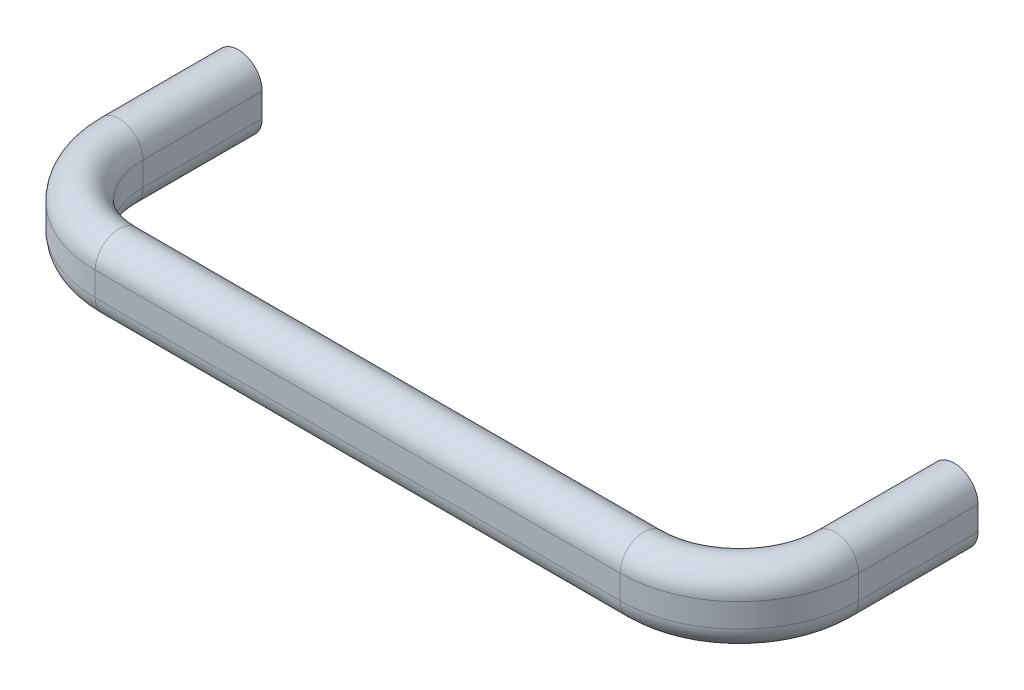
ISO-10303-21;
HEADER;
FILE_DESCRIPTION(('STEP AP214'),'2;1');
FILE_NAME('part.step','',(''),(''),'','','');
FILE_SCHEMA(('AUTOMOTIVE_DESIGN { 1 0 10303 214 1 1 1 1 }'));
ENDSEC;
DATA;
#1=APPLICATION_CONTEXT('core data for automotive mechanical design processes');
#2=APPLICATION_PROTOCOL_DEFINITION('international standard','automotive_design',2000,#1);
#3=PRODUCT_CONTEXT('',#1,'mechanical');
#4=PRODUCT('Part','Part','',(#3));
#5=PRODUCT_RELATED_PRODUCT_CATEGORY('part','',(#4));
#6=PRODUCT_DEFINITION_FORMATION('','',#4);
#7=PRODUCT_DEFINITION_CONTEXT('part definition',#1,'design');
#8=PRODUCT_DEFINITION('design','',#6,#7);
#9=PRODUCT_DEFINITION_SHAPE('','',#8);
#10=(LENGTH_UNIT() NAMED_UNIT(*) SI_UNIT(.MILLI.,.METRE.));
#11=(NAMED_UNIT(*) PLANE_ANGLE_UNIT() SI_UNIT($,.RADIAN.));
#12=(NAMED_UNIT(*) SI_UNIT($,.STERADIAN.) SOLID_ANGLE_UNIT());
#13=UNCERTAINTY_MEASURE_WITH_UNIT(LENGTH_MEASURE(1.E-05),#10,'distance_accuracy_value','');
#14=(GEOMETRIC_REPRESENTATION_CONTEXT(3) GLOBAL_UNCERTAINTY_ASSIGNED_CONTEXT((#13)) GLOBAL_UNIT_ASSIGNED_CONTEXT((#10,
#11,#12)) REPRESENTATION_CONTEXT('',''));
#15=CARTESIAN_POINT('',(0.,0.,0.));
#16=DIRECTION('',(0.,0.,1.));
#17=DIRECTION('',(1.,0.,0.));
#18=AXIS2_PLACEMENT_3D('',#15,#16,#17);
#19=CARTESIAN_POINT('',(0.,2.,0.));
#20=DIRECTION('',(0.,0.,-1.));
#21=DIRECTION('',(0.,1.,0.));
#22=AXIS2_PLACEMENT_3D('',#19,#20,#21);
#23=PLANE('',#22);
#24=CARTESIAN_POINT('',(0.,2.,0.));
#25=DIRECTION('',(0.,0.,-1.));
#26=DIRECTION('',(0.,1.,0.));
#27=AXIS2_PLACEMENT_3D('',#24,#25,#26);
#28=CIRCLE('',#27,4.);
#29=CARTESIAN_POINT('',(-4.,2.,0.));
#30=VERTEX_POINT('',#29);
#31=CARTESIAN_POINT('',(4.,2.,0.));
#32=VERTEX_POINT('',#31);
#33=EDGE_CURVE('E31',#30,#32,#28,.T.);
#34=ORIENTED_EDGE('',*,*,#33,.T.);
#35=DIRECTION('',(0.,-1.,0.));
#36=VECTOR('',#35,1.);
#37=CARTESIAN_POINT('',(4.,2.,0.));
#38=LINE('',#37,#36);
#39=CARTESIAN_POINT('',(4.,-2.,0.));
#40=VERTEX_POINT('',#39);
#41=EDGE_CURVE('E18',#32,#40,#38,.T.);
#42=ORIENTED_EDGE('',*,*,#41,.T.);
#43=CARTESIAN_POINT('',(0.,-2.,0.));
#44=DIRECTION('',(0.,0.,-1.));
#45=DIRECTION('',(0.,1.,0.));
#46=AXIS2_PLACEMENT_3D('',#43,#44,#45);
#47=CIRCLE('',#46,4.);
#48=CARTESIAN_POINT('',(-4.,-2.,0.));
#49=VERTEX_POINT('',#48);
#50=EDGE_CURVE('E39',#40,#49,#47,.T.);
#51=ORIENTED_EDGE('',*,*,#50,.T.);
#52=DIRECTION('',(0.,-1.,0.));
#53=VECTOR('',#52,1.);
#54=CARTESIAN_POINT('',(-4.,2.,0.));
#55=LINE('',#54,#53);
#56=EDGE_CURVE('E230',#30,#49,#55,.T.);
#57=ORIENTED_EDGE('',*,*,#56,.F.);
#58=EDGE_LOOP('',(#34,#42,#51,#57));
#59=FACE_BOUND('',#58,.T.);
#60=CARTESIAN_POINT('',(0.,0.,-2.28837131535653E-13));
#61=DIRECTION('',(0.,0.,-1.));
#62=DIRECTION('',(0.,1.,0.));
#63=AXIS2_PLACEMENT_3D('',#60,#61,#62);
#64=CIRCLE('',#63,2.96700000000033);
#65=CARTESIAN_POINT('',(0.,2.96700000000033,-2.28837131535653E-13));
#66=VERTEX_POINT('',#65);
#67=EDGE_CURVE('E542',#66,#66,#64,.T.);
#68=ORIENTED_EDGE('',*,*,#67,.F.);
#69=EDGE_LOOP('',(#68));
#70=FACE_BOUND('',#69,.T.);
#71=ADVANCED_FACE('F14',(#59,#70),#23,.T.);
#72=CARTESIAN_POINT('',(120.,2.,0.));
#73=DIRECTION('',(0.,0.,1.));
#74=DIRECTION('',(0.,1.,0.));
#75=AXIS2_PLACEMENT_3D('',#72,#73,#74);
#76=PLANE('',#75);
#77=CARTESIAN_POINT('',(120.,2.,0.));
#78=DIRECTION('',(0.,0.,1.));
#79=DIRECTION('',(0.,1.,0.));
#80=AXIS2_PLACEMENT_3D('',#77,#78,#79);
#81=CIRCLE('',#80,4.);
#82=CARTESIAN_POINT('',(124.,2.,0.));
#83=VERTEX_POINT('',#82);
#84=CARTESIAN_POINT('',(116.,2.,0.));
#85=VERTEX_POINT('',#84);
#86=EDGE_CURVE('E107',#83,#85,#81,.T.);
#87=ORIENTED_EDGE('',*,*,#86,.F.);
#88=DIRECTION('',(0.,-1.,0.));
#89=VECTOR('',#88,1.);
#90=CARTESIAN_POINT('',(124.,2.,0.));
#91=LINE('',#90,#89);
#92=CARTESIAN_POINT('',(124.,-2.,0.));
#93=VERTEX_POINT('',#92);
#94=EDGE_CURVE('E136',#83,#93,#91,.T.);
#95=ORIENTED_EDGE('',*,*,#94,.T.);
#96=CARTESIAN_POINT('',(120.,-2.,0.));
#97=DIRECTION('',(0.,0.,1.));
#98=DIRECTION('',(0.,1.,0.));
#99=AXIS2_PLACEMENT_3D('',#96,#97,#98);
#100=CIRCLE('',#99,4.);
#101=CARTESIAN_POINT('',(116.,-2.,0.));
#102=VERTEX_POINT('',#101);
#103=EDGE_CURVE('E134',#102,#93,#100,.T.);
#104=ORIENTED_EDGE('',*,*,#103,.F.);
#105=DIRECTION('',(0.,-1.,0.));
#106=VECTOR('',#105,1.);
#107=CARTESIAN_POINT('',(116.,2.,0.));
#108=LINE('',#107,#106);
#109=EDGE_CURVE('E119',#85,#102,#108,.T.);
#110=ORIENTED_EDGE('',*,*,#109,.F.);
#111=EDGE_LOOP('',(#87,#95,#104,#110));
#112=FACE_BOUND('',#111,.T.);
#113=CARTESIAN_POINT('',(120.,0.,-2.28837131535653E-13));
#114=DIRECTION('',(0.,0.,1.));
#115=DIRECTION('',(0.,1.,0.));
#116=AXIS2_PLACEMENT_3D('',#113,#114,#115);
#117=CIRCLE('',#116,2.96700000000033);
#118=CARTESIAN_POINT('',(120.,2.96700000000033,-2.28837131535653E-13));
#119=VERTEX_POINT('',#118);
#120=EDGE_CURVE('E120',#119,#119,#117,.T.);
#121=ORIENTED_EDGE('',*,*,#120,.T.);
#122=EDGE_LOOP('',(#121));
#123=FACE_BOUND('',#122,.T.);
#124=ADVANCED_FACE('F132',(#112,#123),#76,.F.);
#125=CARTESIAN_POINT('',(4.,2.,20.));
#126=DIRECTION('',(1.,0.,0.));
#127=DIRECTION('',(0.,1.,0.));
#128=AXIS2_PLACEMENT_3D('',#125,#126,#127);
#129=PLANE('',#128);
#130=DIRECTION('',(0.,-1.,0.));
#131=VECTOR('',#130,1.);
#132=CARTESIAN_POINT('',(4.,2.,20.));
#133=LINE('',#132,#131);
#134=CARTESIAN_POINT('',(4.,2.,20.));
#135=VERTEX_POINT('',#134);
#136=CARTESIAN_POINT('',(4.,-2.,20.));
#137=VERTEX_POINT('',#136);
#138=EDGE_CURVE('E204',#135,#137,#133,.T.);
#139=ORIENTED_EDGE('',*,*,#138,.T.);
#140=DIRECTION('',(0.,0.,-1.));
#141=VECTOR('',#140,1.);
#142=CARTESIAN_POINT('',(4.,-2.,20.));
#143=LINE('',#142,#141);
#144=EDGE_CURVE('E23',#137,#40,#143,.T.);
#145=ORIENTED_EDGE('',*,*,#144,.T.);
#146=ORIENTED_EDGE('',*,*,#41,.F.);
#147=DIRECTION('',(0.,0.,-1.));
#148=VECTOR('',#147,1.);
#149=CARTESIAN_POINT('',(4.,2.,20.));
#150=LINE('',#149,#148);
#151=EDGE_CURVE('E9',#135,#32,#150,.T.);
#152=ORIENTED_EDGE('',*,*,#151,.F.);
#153=EDGE_LOOP('',(#139,#145,#146,#152));
#154=FACE_BOUND('',#153,.T.);
#155=ADVANCED_FACE('F16',(#154),#129,.T.);
#156=CARTESIAN_POINT('',(0.,-2.,20.));
#157=DIRECTION('',(0.,0.,-1.));
#158=DIRECTION('',(0.,-1.,0.));
#159=AXIS2_PLACEMENT_3D('',#156,#157,#158);
#160=CYLINDRICAL_SURFACE('',#159,4.);
#161=CARTESIAN_POINT('',(0.,-2.,20.));
#162=DIRECTION('',(0.,0.,-1.));
#163=DIRECTION('',(0.,1.,0.));
#164=AXIS2_PLACEMENT_3D('',#161,#162,#163);
#165=CIRCLE('',#164,4.);
#166=CARTESIAN_POINT('',(-4.,-2.,20.));
#167=VERTEX_POINT('',#166);
#168=EDGE_CURVE('E217',#137,#167,#165,.T.);
#169=ORIENTED_EDGE('',*,*,#168,.T.);
#170=DIRECTION('',(0.,0.,-1.));
#171=VECTOR('',#170,1.);
#172=CARTESIAN_POINT('',(-4.,-2.,20.));
#173=LINE('',#172,#171);
#174=EDGE_CURVE('E225',#167,#49,#173,.T.);
#175=ORIENTED_EDGE('',*,*,#174,.T.);
#176=ORIENTED_EDGE('',*,*,#50,.F.);
#177=ORIENTED_EDGE('',*,*,#144,.F.);
#178=EDGE_LOOP('',(#169,#175,#176,#177));
#179=FACE_BOUND('',#178,.T.);
#180=ADVANCED_FACE('F235',(#179),#160,.T.);
#181=CARTESIAN_POINT('',(-4.,2.,20.));
#182=DIRECTION('',(1.,0.,0.));
#183=DIRECTION('',(0.,1.,0.));
#184=AXIS2_PLACEMENT_3D('',#181,#182,#183);
#185=PLANE('',#184);
#186=DIRECTION('',(0.,-1.,0.));
#187=VECTOR('',#186,1.);
#188=CARTESIAN_POINT('',(-4.,2.,20.));
#189=LINE('',#188,#187);
#190=CARTESIAN_POINT('',(-4.,2.,20.));
#191=VERTEX_POINT('',#190);
#192=EDGE_CURVE('E214',#191,#167,#189,.T.);
#193=ORIENTED_EDGE('',*,*,#192,.F.);
#194=DIRECTION('',(0.,0.,-1.));
#195=VECTOR('',#194,1.);
#196=CARTESIAN_POINT('',(-4.,2.,20.));
#197=LINE('',#196,#195);
#198=EDGE_CURVE('E222',#191,#30,#197,.T.);
#199=ORIENTED_EDGE('',*,*,#198,.T.);
#200=ORIENTED_EDGE('',*,*,#56,.T.);
#201=ORIENTED_EDGE('',*,*,#174,.F.);
#202=EDGE_LOOP('',(#193,#199,#200,#201));
#203=FACE_BOUND('',#202,.T.);
#204=ADVANCED_FACE('F292',(#203),#185,.F.);
#205=CARTESIAN_POINT('',(0.,2.,20.));
#206=DIRECTION('',(0.,0.,-1.));
#207=DIRECTION('',(0.,-1.,0.));
#208=AXIS2_PLACEMENT_3D('',#205,#206,#207);
#209=CYLINDRICAL_SURFACE('',#208,4.);
#210=CARTESIAN_POINT('',(0.,2.,20.));
#211=DIRECTION('',(0.,0.,-1.));
#212=DIRECTION('',(0.,1.,0.));
#213=AXIS2_PLACEMENT_3D('',#210,#211,#212);
#214=CIRCLE('',#213,4.);
#215=EDGE_CURVE('E190',#191,#135,#214,.T.);
#216=ORIENTED_EDGE('',*,*,#215,.T.);
#217=ORIENTED_EDGE('',*,*,#151,.T.);
#218=ORIENTED_EDGE('',*,*,#33,.F.);
#219=ORIENTED_EDGE('',*,*,#198,.F.);
#220=EDGE_LOOP('',(#216,#217,#218,#219));
#221=FACE_BOUND('',#220,.T.);
#222=ADVANCED_FACE('F283',(#221),#209,.T.);
#223=CARTESIAN_POINT('',(16.,0.,20.));
#224=DIRECTION('',(0.,-1.,0.));
#225=DIRECTION('',(1.,0.,0.));
#226=AXIS2_PLACEMENT_3D('',#223,#224,#225);
#227=CYLINDRICAL_SURFACE('',#226,12.);
#228=DIRECTION('',(0.,-1.,0.));
#229=VECTOR('',#228,1.);
#230=CARTESIAN_POINT('',(16.,2.,32.));
#231=LINE('',#230,#229);
#232=CARTESIAN_POINT('',(16.,2.,32.));
#233=VERTEX_POINT('',#232);
#234=CARTESIAN_POINT('',(16.,-2.,32.));
#235=VERTEX_POINT('',#234);
#236=EDGE_CURVE('E181',#233,#235,#231,.T.);
#237=ORIENTED_EDGE('',*,*,#236,.T.);
#238=CARTESIAN_POINT('',(16.,-2.,20.));
#239=DIRECTION('',(0.,-1.,0.));
#240=DIRECTION('',(1.,0.,0.));
#241=AXIS2_PLACEMENT_3D('',#238,#239,#240);
#242=CIRCLE('',#241,12.);
#243=EDGE_CURVE('E207',#235,#137,#242,.T.);
#244=ORIENTED_EDGE('',*,*,#243,.T.);
#245=ORIENTED_EDGE('',*,*,#138,.F.);
#246=CARTESIAN_POINT('',(16.,2.,20.));
#247=DIRECTION('',(0.,-1.,0.));
#248=DIRECTION('',(1.,0.,0.));
#249=AXIS2_PLACEMENT_3D('',#246,#247,#248);
#250=CIRCLE('',#249,12.);
#251=EDGE_CURVE('E210',#233,#135,#250,.T.);
#252=ORIENTED_EDGE('',*,*,#251,.F.);
#253=EDGE_LOOP('',(#237,#244,#245,#252));
#254=FACE_BOUND('',#253,.T.);
#255=ADVANCED_FACE('F281',(#254),#227,.F.);
#256=CARTESIAN_POINT('',(16.,-2.,20.));
#257=DIRECTION('',(0.,-1.,0.));
#258=DIRECTION('',(1.,0.,0.));
#259=AXIS2_PLACEMENT_3D('',#256,#257,#258);
#260=TOROIDAL_SURFACE('',#259,16.,4.);
#261=CARTESIAN_POINT('',(16.,-2.,36.));
#262=DIRECTION('',(-1.,0.,0.));
#263=DIRECTION('',(0.,1.,0.));
#264=AXIS2_PLACEMENT_3D('',#261,#262,#263);
#265=CIRCLE('',#264,4.);
#266=CARTESIAN_POINT('',(16.,-2.,40.));
#267=VERTEX_POINT('',#266);
#268=EDGE_CURVE('E195',#235,#267,#265,.T.);
#269=ORIENTED_EDGE('',*,*,#268,.T.);
#270=CARTESIAN_POINT('',(16.,-2.,20.));
#271=DIRECTION('',(0.,-1.,0.));
#272=DIRECTION('',(1.,0.,0.));
#273=AXIS2_PLACEMENT_3D('',#270,#271,#272);
#274=CIRCLE('',#273,20.);
#275=EDGE_CURVE('E203',#267,#167,#274,.T.);
#276=ORIENTED_EDGE('',*,*,#275,.T.);
#277=ORIENTED_EDGE('',*,*,#168,.F.);
#278=ORIENTED_EDGE('',*,*,#243,.F.);
#279=EDGE_LOOP('',(#269,#276,#277,#278));
#280=FACE_BOUND('',#279,.T.);
#281=ADVANCED_FACE('F244',(#280),#260,.T.);
#282=CARTESIAN_POINT('',(16.,0.,20.));
#283=DIRECTION('',(0.,-1.,0.));
#284=DIRECTION('',(1.,0.,0.));
#285=AXIS2_PLACEMENT_3D('',#282,#283,#284);
#286=CYLINDRICAL_SURFACE('',#285,20.);
#287=DIRECTION('',(0.,-1.,0.));
#288=VECTOR('',#287,1.);
#289=CARTESIAN_POINT('',(16.,2.,40.));
#290=LINE('',#289,#288);
#291=CARTESIAN_POINT('',(16.,2.,40.));
#292=VERTEX_POINT('',#291);
#293=EDGE_CURVE('E192',#292,#267,#290,.T.);
#294=ORIENTED_EDGE('',*,*,#293,.F.);
#295=CARTESIAN_POINT('',(16.,2.,20.));
#296=DIRECTION('',(0.,-1.,0.));
#297=DIRECTION('',(1.,0.,0.));
#298=AXIS2_PLACEMENT_3D('',#295,#296,#297);
#299=CIRCLE('',#298,20.);
#300=EDGE_CURVE('E200',#292,#191,#299,.T.);
#301=ORIENTED_EDGE('',*,*,#300,.T.);
#302=ORIENTED_EDGE('',*,*,#192,.T.);
#303=ORIENTED_EDGE('',*,*,#275,.F.);
#304=EDGE_LOOP('',(#294,#301,#302,#303));
#305=FACE_BOUND('',#304,.T.);
#306=ADVANCED_FACE('F241',(#305),#286,.T.);
#307=CARTESIAN_POINT('',(16.,2.,20.));
#308=DIRECTION('',(0.,-1.,0.));
#309=DIRECTION('',(1.,0.,0.));
#310=AXIS2_PLACEMENT_3D('',#307,#308,#309);
#311=TOROIDAL_SURFACE('',#310,16.,4.);
#312=CARTESIAN_POINT('',(16.,2.,36.));
#313=DIRECTION('',(-1.,0.,0.));
#314=DIRECTION('',(0.,1.,0.));
#315=AXIS2_PLACEMENT_3D('',#312,#313,#314);
#316=CIRCLE('',#315,4.);
#317=EDGE_CURVE('E167',#292,#233,#316,.T.);
#318=ORIENTED_EDGE('',*,*,#317,.T.);
#319=ORIENTED_EDGE('',*,*,#251,.T.);
#320=ORIENTED_EDGE('',*,*,#215,.F.);
#321=ORIENTED_EDGE('',*,*,#300,.F.);
#322=EDGE_LOOP('',(#318,#319,#320,#321));
#323=FACE_BOUND('',#322,.T.);
#324=ADVANCED_FACE('F279',(#323),#311,.T.);
#325=CARTESIAN_POINT('',(104.,2.,32.));
#326=DIRECTION('',(0.,0.,-1.));
#327=DIRECTION('',(-1.,0.,0.));
#328=AXIS2_PLACEMENT_3D('',#325,#326,#327);
#329=PLANE('',#328);
#330=DIRECTION('',(0.,-1.,0.));
#331=VECTOR('',#330,1.);
#332=CARTESIAN_POINT('',(104.,2.,32.));
#333=LINE('',#332,#331);
#334=CARTESIAN_POINT('',(104.,2.,32.));
#335=VERTEX_POINT('',#334);
#336=CARTESIAN_POINT('',(104.,-2.,32.));
#337=VERTEX_POINT('',#336);
#338=EDGE_CURVE('E158',#335,#337,#333,.T.);
#339=ORIENTED_EDGE('',*,*,#338,.T.);
#340=DIRECTION('',(-1.,0.,0.));
#341=VECTOR('',#340,1.);
#342=CARTESIAN_POINT('',(104.,-2.,32.));
#343=LINE('',#342,#341);
#344=EDGE_CURVE('E184',#337,#235,#343,.T.);
#345=ORIENTED_EDGE('',*,*,#344,.T.);
#346=ORIENTED_EDGE('',*,*,#236,.F.);
#347=DIRECTION('',(-1.,0.,0.));
#348=VECTOR('',#347,1.);
#349=CARTESIAN_POINT('',(104.,2.,32.));
#350=LINE('',#349,#348);
#351=EDGE_CURVE('E187',#335,#233,#350,.T.);
#352=ORIENTED_EDGE('',*,*,#351,.F.);
#353=EDGE_LOOP('',(#339,#345,#346,#352));
#354=FACE_BOUND('',#353,.T.);
#355=ADVANCED_FACE('F273',(#354),#329,.T.);
#356=CARTESIAN_POINT('',(104.,-2.,36.));
#357=DIRECTION('',(-1.,0.,0.));
#358=DIRECTION('',(0.,0.,1.));
#359=AXIS2_PLACEMENT_3D('',#356,#357,#358);
#360=CYLINDRICAL_SURFACE('',#359,4.);
#361=CARTESIAN_POINT('',(104.,-2.,36.));
#362=DIRECTION('',(-1.,0.,0.));
#363=DIRECTION('',(0.,1.,0.));
#364=AXIS2_PLACEMENT_3D('',#361,#362,#363);
#365=CIRCLE('',#364,4.);
#366=CARTESIAN_POINT('',(104.,-2.,40.));
#367=VERTEX_POINT('',#366);
#368=EDGE_CURVE('E172',#337,#367,#365,.T.);
#369=ORIENTED_EDGE('',*,*,#368,.T.);
#370=DIRECTION('',(-1.,0.,0.));
#371=VECTOR('',#370,1.);
#372=CARTESIAN_POINT('',(104.,-2.,40.));
#373=LINE('',#372,#371);
#374=EDGE_CURVE('E180',#367,#267,#373,.T.);
#375=ORIENTED_EDGE('',*,*,#374,.T.);
#376=ORIENTED_EDGE('',*,*,#268,.F.);
#377=ORIENTED_EDGE('',*,*,#344,.F.);
#378=EDGE_LOOP('',(#369,#375,#376,#377));
#379=FACE_BOUND('',#378,.T.);
#380=ADVANCED_FACE('F251',(#379),#360,.T.);
#381=CARTESIAN_POINT('',(104.,2.,40.));
#382=DIRECTION('',(0.,0.,-1.));
#383=DIRECTION('',(-1.,0.,0.));
#384=AXIS2_PLACEMENT_3D('',#381,#382,#383);
#385=PLANE('',#384);
#386=DIRECTION('',(0.,-1.,0.));
#387=VECTOR('',#386,1.);
#388=CARTESIAN_POINT('',(104.,2.,40.));
#389=LINE('',#388,#387);
#390=CARTESIAN_POINT('',(104.,2.,40.));
#391=VERTEX_POINT('',#390);
#392=EDGE_CURVE('E169',#391,#367,#389,.T.);
#393=ORIENTED_EDGE('',*,*,#392,.F.);
#394=DIRECTION('',(-1.,0.,0.));
#395=VECTOR('',#394,1.);
#396=CARTESIAN_POINT('',(104.,2.,40.));
#397=LINE('',#396,#395);
#398=EDGE_CURVE('E177',#391,#292,#397,.T.);
#399=ORIENTED_EDGE('',*,*,#398,.T.);
#400=ORIENTED_EDGE('',*,*,#293,.T.);
#401=ORIENTED_EDGE('',*,*,#374,.F.);
#402=EDGE_LOOP('',(#393,#399,#400,#401));
#403=FACE_BOUND('',#402,.T.);
#404=ADVANCED_FACE('F249',(#403),#385,.F.);
#405=CARTESIAN_POINT('',(104.,2.,36.));
#406=DIRECTION('',(-1.,0.,0.));
#407=DIRECTION('',(0.,0.,1.));
#408=AXIS2_PLACEMENT_3D('',#405,#406,#407);
#409=CYLINDRICAL_SURFACE('',#408,4.);
#410=CARTESIAN_POINT('',(104.,2.,36.));
#411=DIRECTION('',(-1.,0.,0.));
#412=DIRECTION('',(0.,1.,0.));
#413=AXIS2_PLACEMENT_3D('',#410,#411,#412);
#414=CIRCLE('',#413,4.);
#415=EDGE_CURVE('E129',#391,#335,#414,.T.);
#416=ORIENTED_EDGE('',*,*,#415,.T.);
#417=ORIENTED_EDGE('',*,*,#351,.T.);
#418=ORIENTED_EDGE('',*,*,#317,.F.);
#419=ORIENTED_EDGE('',*,*,#398,.F.);
#420=EDGE_LOOP('',(#416,#417,#418,#419));
#421=FACE_BOUND('',#420,.T.);
#422=ADVANCED_FACE('F276',(#421),#409,.T.);
#423=CARTESIAN_POINT('',(104.,0.,20.));
#424=DIRECTION('',(0.,-1.,0.));
#425=DIRECTION('',(1.,0.,0.));
#426=AXIS2_PLACEMENT_3D('',#423,#424,#425);
#427=CYLINDRICAL_SURFACE('',#426,12.);
#428=DIRECTION('',(0.,-1.,0.));
#429=VECTOR('',#428,1.);
#430=CARTESIAN_POINT('',(116.,2.,20.));
#431=LINE('',#430,#429);
#432=CARTESIAN_POINT('',(116.,2.,20.));
#433=VERTEX_POINT('',#432);
#434=CARTESIAN_POINT('',(116.,-2.,20.));
#435=VERTEX_POINT('',#434);
#436=EDGE_CURVE('E128',#433,#435,#431,.T.);
#437=ORIENTED_EDGE('',*,*,#436,.T.);
#438=CARTESIAN_POINT('',(104.,-2.,20.));
#439=DIRECTION('',(0.,-1.,0.));
#440=DIRECTION('',(1.,0.,0.));
#441=AXIS2_PLACEMENT_3D('',#438,#439,#440);
#442=CIRCLE('',#441,12.);
#443=EDGE_CURVE('E161',#435,#337,#442,.T.);
#444=ORIENTED_EDGE('',*,*,#443,.T.);
#445=ORIENTED_EDGE('',*,*,#338,.F.);
#446=CARTESIAN_POINT('',(104.,2.,20.));
#447=DIRECTION('',(0.,-1.,0.));
#448=DIRECTION('',(1.,0.,0.));
#449=AXIS2_PLACEMENT_3D('',#446,#447,#448);
#450=CIRCLE('',#449,12.);
#451=EDGE_CURVE('E164',#433,#335,#450,.T.);
#452=ORIENTED_EDGE('',*,*,#451,.F.);
#453=EDGE_LOOP('',(#437,#444,#445,#452));
#454=FACE_BOUND('',#453,.T.);
#455=ADVANCED_FACE('F270',(#454),#427,.F.);
#456=CARTESIAN_POINT('',(104.,-2.,20.));
#457=DIRECTION('',(0.,-1.,0.));
#458=DIRECTION('',(1.,0.,0.));
#459=AXIS2_PLACEMENT_3D('',#456,#457,#458);
#460=TOROIDAL_SURFACE('',#459,16.,4.);
#461=CARTESIAN_POINT('',(120.,-2.,20.));
#462=DIRECTION('',(0.,0.,1.));
#463=DIRECTION('',(0.,1.,0.));
#464=AXIS2_PLACEMENT_3D('',#461,#462,#463);
#465=CIRCLE('',#464,4.);
#466=CARTESIAN_POINT('',(124.,-2.,20.));
#467=VERTEX_POINT('',#466);
#468=EDGE_CURVE('E144',#435,#467,#465,.T.);
#469=ORIENTED_EDGE('',*,*,#468,.T.);
#470=CARTESIAN_POINT('',(104.,-2.,20.));
#471=DIRECTION('',(0.,-1.,0.));
#472=DIRECTION('',(1.,0.,0.));
#473=AXIS2_PLACEMENT_3D('',#470,#471,#472);
#474=CIRCLE('',#473,20.);
#475=EDGE_CURVE('E157',#467,#367,#474,.T.);
#476=ORIENTED_EDGE('',*,*,#475,.T.);
#477=ORIENTED_EDGE('',*,*,#368,.F.);
#478=ORIENTED_EDGE('',*,*,#443,.F.);
#479=EDGE_LOOP('',(#469,#476,#477,#478));
#480=FACE_BOUND('',#479,.T.);
#481=ADVANCED_FACE('F259',(#480),#460,.T.);
#482=CARTESIAN_POINT('',(104.,0.,20.));
#483=DIRECTION('',(0.,-1.,0.));
#484=DIRECTION('',(1.,0.,0.));
#485=AXIS2_PLACEMENT_3D('',#482,#483,#484);
#486=CYLINDRICAL_SURFACE('',#485,20.);
#487=DIRECTION('',(0.,-1.,0.));
#488=VECTOR('',#487,1.);
#489=CARTESIAN_POINT('',(124.,2.,20.));
#490=LINE('',#489,#488);
#491=CARTESIAN_POINT('',(124.,2.,20.));
#492=VERTEX_POINT('',#491);
#493=EDGE_CURVE('E146',#492,#467,#490,.T.);
#494=ORIENTED_EDGE('',*,*,#493,.F.);
#495=CARTESIAN_POINT('',(104.,2.,20.));
#496=DIRECTION('',(0.,-1.,0.));
#497=DIRECTION('',(1.,0.,0.));
#498=AXIS2_PLACEMENT_3D('',#495,#496,#497);
#499=CIRCLE('',#498,20.);
#500=EDGE_CURVE('E154',#492,#391,#499,.T.);
#501=ORIENTED_EDGE('',*,*,#500,.T.);
#502=ORIENTED_EDGE('',*,*,#392,.T.);
#503=ORIENTED_EDGE('',*,*,#475,.F.);
#504=EDGE_LOOP('',(#494,#501,#502,#503));
#505=FACE_BOUND('',#504,.T.);
#506=ADVANCED_FACE('F256',(#505),#486,.T.);
#507=CARTESIAN_POINT('',(104.,2.,20.));
#508=DIRECTION('',(0.,-1.,0.));
#509=DIRECTION('',(1.,0.,0.));
#510=AXIS2_PLACEMENT_3D('',#507,#508,#509);
#511=TOROIDAL_SURFACE('',#510,16.,4.);
#512=CARTESIAN_POINT('',(120.,2.,20.));
#513=DIRECTION('',(0.,0.,1.));
#514=DIRECTION('',(0.,1.,0.));
#515=AXIS2_PLACEMENT_3D('',#512,#513,#514);
#516=CIRCLE('',#515,4.);
#517=EDGE_CURVE('E141',#492,#433,#516,.T.);
#518=ORIENTED_EDGE('',*,*,#517,.T.);
#519=ORIENTED_EDGE('',*,*,#451,.T.);
#520=ORIENTED_EDGE('',*,*,#415,.F.);
#521=ORIENTED_EDGE('',*,*,#500,.F.);
#522=EDGE_LOOP('',(#518,#519,#520,#521));
#523=FACE_BOUND('',#522,.T.);
#524=ADVANCED_FACE('F267',(#523),#511,.T.);
#525=CARTESIAN_POINT('',(120.,2.,20.));
#526=DIRECTION('',(0.,0.,-1.));
#527=DIRECTION('',(0.,-1.,0.));
#528=AXIS2_PLACEMENT_3D('',#525,#526,#527);
#529=CYLINDRICAL_SURFACE('',#528,4.);
#530=DIRECTION('',(0.,0.,-1.));
#531=VECTOR('',#530,1.);
#532=CARTESIAN_POINT('',(116.,2.,20.));
#533=LINE('',#532,#531);
#534=EDGE_CURVE('E111',#433,#85,#533,.T.);
#535=ORIENTED_EDGE('',*,*,#534,.F.);
#536=ORIENTED_EDGE('',*,*,#517,.F.);
#537=DIRECTION('',(0.,0.,-1.));
#538=VECTOR('',#537,1.);
#539=CARTESIAN_POINT('',(124.,2.,20.));
#540=LINE('',#539,#538);
#541=EDGE_CURVE('E114',#492,#83,#540,.T.);
#542=ORIENTED_EDGE('',*,*,#541,.T.);
#543=ORIENTED_EDGE('',*,*,#86,.T.);
#544=EDGE_LOOP('',(#535,#536,#542,#543));
#545=FACE_BOUND('',#544,.T.);
#546=ADVANCED_FACE('F109',(#545),#529,.T.);
#547=CARTESIAN_POINT('',(116.,2.,20.));
#548=DIRECTION('',(1.,0.,0.));
#549=DIRECTION('',(0.,1.,0.));
#550=AXIS2_PLACEMENT_3D('',#547,#548,#549);
#551=PLANE('',#550);
#552=DIRECTION('',(0.,0.,-1.));
#553=VECTOR('',#552,1.);
#554=CARTESIAN_POINT('',(116.,-2.,20.));
#555=LINE('',#554,#553);
#556=EDGE_CURVE('E130',#435,#102,#555,.T.);
#557=ORIENTED_EDGE('',*,*,#556,.F.);
#558=ORIENTED_EDGE('',*,*,#436,.F.);
#559=ORIENTED_EDGE('',*,*,#534,.T.);
#560=ORIENTED_EDGE('',*,*,#109,.T.);
#561=EDGE_LOOP('',(#557,#558,#559,#560));
#562=FACE_BOUND('',#561,.T.);
#563=ADVANCED_FACE('F125',(#562),#551,.F.);
#564=CARTESIAN_POINT('',(120.,-2.,20.));
#565=DIRECTION('',(0.,0.,-1.));
#566=DIRECTION('',(0.,-1.,0.));
#567=AXIS2_PLACEMENT_3D('',#564,#565,#566);
#568=CYLINDRICAL_SURFACE('',#567,4.);
#569=DIRECTION('',(0.,0.,-1.));
#570=VECTOR('',#569,1.);
#571=CARTESIAN_POINT('',(124.,-2.,20.));
#572=LINE('',#571,#570);
#573=EDGE_CURVE('E150',#467,#93,#572,.T.);
#574=ORIENTED_EDGE('',*,*,#573,.F.);
#575=ORIENTED_EDGE('',*,*,#468,.F.);
#576=ORIENTED_EDGE('',*,*,#556,.T.);
#577=ORIENTED_EDGE('',*,*,#103,.T.);
#578=EDGE_LOOP('',(#574,#575,#576,#577));
#579=FACE_BOUND('',#578,.T.);
#580=ADVANCED_FACE('F262',(#579),#568,.T.);
#581=CARTESIAN_POINT('',(124.,2.,20.));
#582=DIRECTION('',(1.,0.,0.));
#583=DIRECTION('',(0.,1.,0.));
#584=AXIS2_PLACEMENT_3D('',#581,#582,#583);
#585=PLANE('',#584);
#586=ORIENTED_EDGE('',*,*,#493,.T.);
#587=ORIENTED_EDGE('',*,*,#573,.T.);
#588=ORIENTED_EDGE('',*,*,#94,.F.);
#589=ORIENTED_EDGE('',*,*,#541,.F.);
#590=EDGE_LOOP('',(#586,#587,#588,#589));
#591=FACE_BOUND('',#590,.T.);
#592=ADVANCED_FACE('F264',(#591),#585,.T.);
#593=CARTESIAN_POINT('',(120.,0.,-2.28837131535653E-13));
#594=DIRECTION('',(0.,0.,-1.));
#595=DIRECTION('',(0.,-1.,0.));
#596=AXIS2_PLACEMENT_3D('',#593,#594,#595);
#597=CONICAL_SURFACE('',#596,2.96700000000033,0.785398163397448);
#598=CARTESIAN_POINT('',(120.,0.,0.467000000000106));
#599=DIRECTION('',(0.,0.,-1.));
#600=DIRECTION('',(-1.,0.,0.));
#601=AXIS2_PLACEMENT_3D('',#598,#599,#600);
#602=CIRCLE('',#601,2.5);
#603=CARTESIAN_POINT('',(117.5,0.,0.467000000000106));
#604=VERTEX_POINT('',#603);
#605=EDGE_CURVE('E539',#604,#604,#602,.T.);
#606=ORIENTED_EDGE('',*,*,#605,.F.);
#607=EDGE_LOOP('',(#606));
#608=FACE_BOUND('',#607,.T.);
#609=ORIENTED_EDGE('',*,*,#120,.F.);
#610=EDGE_LOOP('',(#609));
#611=FACE_BOUND('',#610,.T.);
#612=ADVANCED_FACE('F306',(#608,#611),#597,.F.);
#613=CARTESIAN_POINT('',(0.,0.,-2.28837131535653E-13));
#614=DIRECTION('',(0.,0.,-1.));
#615=DIRECTION('',(0.,-1.,0.));
#616=AXIS2_PLACEMENT_3D('',#613,#614,#615);
#617=CONICAL_SURFACE('',#616,2.96700000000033,0.785398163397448);
#618=CARTESIAN_POINT('',(0.,0.,0.467000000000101));
#619=DIRECTION('',(0.,0.,-1.));
#620=DIRECTION('',(-1.,0.,0.));
#621=AXIS2_PLACEMENT_3D('',#618,#619,#620);
#622=CIRCLE('',#621,2.5);
#623=CARTESIAN_POINT('',(-2.5,0.,0.467000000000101));
#624=VERTEX_POINT('',#623);
#625=EDGE_CURVE('E531',#624,#624,#622,.T.);
#626=ORIENTED_EDGE('',*,*,#625,.F.);
#627=EDGE_LOOP('',(#626));
#628=FACE_BOUND('',#627,.T.);
#629=ORIENTED_EDGE('',*,*,#67,.T.);
#630=EDGE_LOOP('',(#629));
#631=FACE_BOUND('',#630,.T.);
#632=ADVANCED_FACE('F414',(#628,#631),#617,.F.);
#633=CARTESIAN_POINT('',(120.,0.,10.));
#634=DIRECTION('',(0.,0.,-1.));
#635=DIRECTION('',(-1.,0.,0.));
#636=AXIS2_PLACEMENT_3D('',#633,#634,#635);
#637=CYLINDRICAL_SURFACE('',#636,2.5);
#638=ORIENTED_EDGE('',*,*,#605,.T.);
#639=EDGE_LOOP('',(#638));
#640=FACE_BOUND('',#639,.T.);
#641=CARTESIAN_POINT('',(120.,0.,10.));
#642=DIRECTION('',(0.,0.,-1.));
#643=DIRECTION('',(-1.,0.,0.));
#644=AXIS2_PLACEMENT_3D('',#641,#642,#643);
#645=CIRCLE('',#644,2.5);
#646=CARTESIAN_POINT('',(117.5,0.,10.));
#647=VERTEX_POINT('',#646);
#648=EDGE_CURVE('E534',#647,#647,#645,.T.);
#649=ORIENTED_EDGE('',*,*,#648,.F.);
#650=EDGE_LOOP('',(#649));
#651=FACE_BOUND('',#650,.T.);
#652=ADVANCED_FACE('F422',(#640,#651),#637,.F.);
#653=CARTESIAN_POINT('',(120.,0.,10.));
#654=DIRECTION('',(0.,0.,-1.));
#655=DIRECTION('',(-1.,0.,0.));
#656=AXIS2_PLACEMENT_3D('',#653,#654,#655);
#657=PLANE('',#656);
#658=ORIENTED_EDGE('',*,*,#648,.T.);
#659=EDGE_LOOP('',(#658));
#660=FACE_BOUND('',#659,.T.);
#661=ADVANCED_FACE('F431',(#660),#657,.T.);
#662=CARTESIAN_POINT('',(0.,0.,10.));
#663=DIRECTION('',(0.,0.,-1.));
#664=DIRECTION('',(-1.,0.,0.));
#665=AXIS2_PLACEMENT_3D('',#662,#663,#664);
#666=CYLINDRICAL_SURFACE('',#665,2.5);
#667=ORIENTED_EDGE('',*,*,#625,.T.);
#668=EDGE_LOOP('',(#667));
#669=FACE_BOUND('',#668,.T.);
#670=CARTESIAN_POINT('',(0.,0.,10.));
#671=DIRECTION('',(0.,0.,-1.));
#672=DIRECTION('',(-1.,0.,0.));
#673=AXIS2_PLACEMENT_3D('',#670,#671,#672);
#674=CIRCLE('',#673,2.5);
#675=CARTESIAN_POINT('',(-2.5,0.,10.));
#676=VERTEX_POINT('',#675);
#677=EDGE_CURVE('E529',#676,#676,#674,.T.);
#678=ORIENTED_EDGE('',*,*,#677,.F.);
#679=EDGE_LOOP('',(#678));
#680=FACE_BOUND('',#679,.T.);
#681=ADVANCED_FACE('F440',(#669,#680),#666,.F.);
#682=CARTESIAN_POINT('',(0.,0.,10.));
#683=DIRECTION('',(0.,0.,-1.));
#684=DIRECTION('',(-1.,0.,0.));
#685=AXIS2_PLACEMENT_3D('',#682,#683,#684);
#686=PLANE('',#685);
#687=ORIENTED_EDGE('',*,*,#677,.T.);
#688=EDGE_LOOP('',(#687));
#689=FACE_BOUND('',#688,.T.);
#690=ADVANCED_FACE('F449',(#689),#686,.T.);
#691=CLOSED_SHELL('',(#71,#124,#155,#180,#204,#222,#255,#281,#306,#324,#355,#380,#404,#422,#455,
#481,#506,#524,#546,#563,#580,#592,#612,#632,#652,#661,#681,#690));
#692=MANIFOLD_SOLID_BREP('B1',#691);
#693=ADVANCED_BREP_SHAPE_REPRESENTATION('',(#18,#692),#14);
#694=SHAPE_DEFINITION_REPRESENTATION(#9,#693);
ENDSEC;
END-ISO-10303-21;
